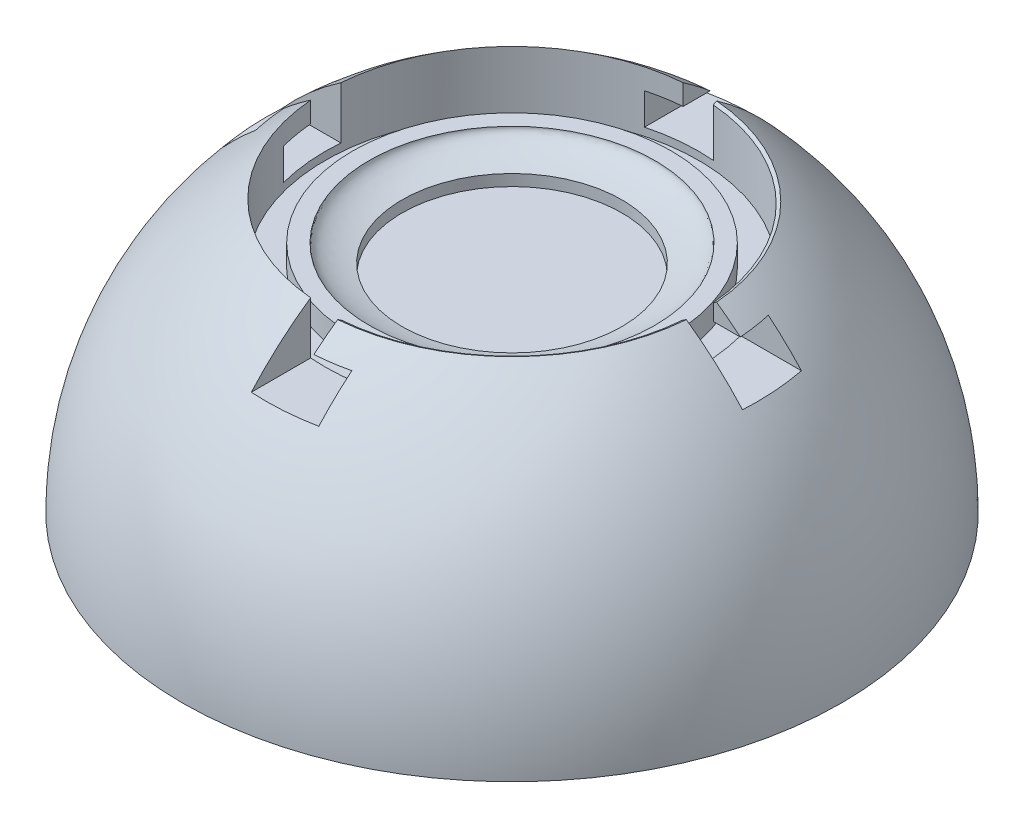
ISO-10303-21;
HEADER;
FILE_DESCRIPTION(('STEP AP214'),'2;1');
FILE_NAME('part.step','',(''),(''),'','','');
FILE_SCHEMA(('AUTOMOTIVE_DESIGN { 1 0 10303 214 1 1 1 1 }'));
ENDSEC;
DATA;
#1=APPLICATION_CONTEXT('core data for automotive mechanical design processes');
#2=APPLICATION_PROTOCOL_DEFINITION('international standard','automotive_design',2000,#1);
#3=PRODUCT_CONTEXT('',#1,'mechanical');
#4=PRODUCT('Part','Part','',(#3));
#5=PRODUCT_RELATED_PRODUCT_CATEGORY('part','',(#4));
#6=PRODUCT_DEFINITION_FORMATION('','',#4);
#7=PRODUCT_DEFINITION_CONTEXT('part definition',#1,'design');
#8=PRODUCT_DEFINITION('design','',#6,#7);
#9=PRODUCT_DEFINITION_SHAPE('','',#8);
#10=(LENGTH_UNIT() NAMED_UNIT(*) SI_UNIT(.MILLI.,.METRE.));
#11=(NAMED_UNIT(*) PLANE_ANGLE_UNIT() SI_UNIT($,.RADIAN.));
#12=(NAMED_UNIT(*) SI_UNIT($,.STERADIAN.) SOLID_ANGLE_UNIT());
#13=UNCERTAINTY_MEASURE_WITH_UNIT(LENGTH_MEASURE(1.E-05),#10,'distance_accuracy_value','');
#14=(GEOMETRIC_REPRESENTATION_CONTEXT(3) GLOBAL_UNCERTAINTY_ASSIGNED_CONTEXT((#13)) GLOBAL_UNIT_ASSIGNED_CONTEXT((#10,
#11,#12)) REPRESENTATION_CONTEXT('',''));
#15=CARTESIAN_POINT('',(0.,0.,0.));
#16=DIRECTION('',(0.,0.,1.));
#17=DIRECTION('',(1.,0.,0.));
#18=AXIS2_PLACEMENT_3D('',#15,#16,#17);
#19=CARTESIAN_POINT('',(0.,6.1,0.));
#20=DIRECTION('',(0.,-1.,0.));
#21=DIRECTION('',(1.,0.,0.));
#22=AXIS2_PLACEMENT_3D('',#19,#20,#21);
#23=CYLINDRICAL_SURFACE('',#22,6.8);
#24=CARTESIAN_POINT('',(0.,7.7,0.));
#25=DIRECTION('',(0.,-1.,0.));
#26=DIRECTION('',(1.,0.,0.));
#27=AXIS2_PLACEMENT_3D('',#24,#25,#26);
#28=CIRCLE('',#27,6.8);
#29=CARTESIAN_POINT('',(6.8,7.7,0.));
#30=VERTEX_POINT('',#29);
#31=EDGE_CURVE('E234',#30,#30,#28,.T.);
#32=ORIENTED_EDGE('',*,*,#31,.T.);
#33=EDGE_LOOP('',(#32));
#34=FACE_BOUND('',#33,.T.);
#35=DIRECTION('',(0.,-1.,0.));
#36=VECTOR('',#35,1.);
#37=CARTESIAN_POINT('',(0.549999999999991,6.1,6.77772085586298));
#38=LINE('',#37,#36);
#39=CARTESIAN_POINT('',(0.549999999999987,9.13736567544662,6.77772085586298));
#40=VERTEX_POINT('',#39);
#41=CARTESIAN_POINT('',(0.549999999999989,9.73736567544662,6.77772085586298));
#42=VERTEX_POINT('',#41);
#43=EDGE_CURVE('E558',#40,#42,#38,.F.);
#44=ORIENTED_EDGE('',*,*,#43,.T.);
#45=CARTESIAN_POINT('',(0.,9.73736567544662,0.));
#46=DIRECTION('',(0.,1.,0.));
#47=DIRECTION('',(-1.,0.,0.));
#48=AXIS2_PLACEMENT_3D('',#45,#46,#47);
#49=CIRCLE('',#48,6.8);
#50=CARTESIAN_POINT('',(6.77772085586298,9.73736567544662,0.550000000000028));
#51=VERTEX_POINT('',#50);
#52=EDGE_CURVE('E56',#42,#51,#49,.T.);
#53=ORIENTED_EDGE('',*,*,#52,.T.);
#54=DIRECTION('',(0.,-1.,0.));
#55=VECTOR('',#54,1.);
#56=CARTESIAN_POINT('',(6.77772085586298,6.1,0.550000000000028));
#57=LINE('',#56,#55);
#58=CARTESIAN_POINT('',(6.77772085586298,7.98736567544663,0.550000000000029));
#59=VERTEX_POINT('',#58);
#60=EDGE_CURVE('E556',#51,#59,#57,.T.);
#61=ORIENTED_EDGE('',*,*,#60,.T.);
#62=CARTESIAN_POINT('',(0.,7.98736567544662,0.));
#63=DIRECTION('',(0.,1.,0.));
#64=DIRECTION('',(-1.,0.,0.));
#65=AXIS2_PLACEMENT_3D('',#62,#63,#64);
#66=CIRCLE('',#65,6.8);
#67=CARTESIAN_POINT('',(6.57095883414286,7.98736567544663,-1.74999999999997));
#68=VERTEX_POINT('',#67);
#69=EDGE_CURVE('E553',#59,#68,#66,.T.);
#70=ORIENTED_EDGE('',*,*,#69,.T.);
#71=DIRECTION('',(0.,-1.,0.));
#72=VECTOR('',#71,1.);
#73=CARTESIAN_POINT('',(6.57095883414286,6.1,-1.74999999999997));
#74=LINE('',#73,#72);
#75=CARTESIAN_POINT('',(6.57095883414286,9.13736567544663,-1.74999999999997));
#76=VERTEX_POINT('',#75);
#77=EDGE_CURVE('E550',#68,#76,#74,.F.);
#78=ORIENTED_EDGE('',*,*,#77,.T.);
#79=CARTESIAN_POINT('',(0.,9.13736567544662,0.));
#80=DIRECTION('',(0.,-1.,0.));
#81=DIRECTION('',(1.,0.,0.));
#82=AXIS2_PLACEMENT_3D('',#79,#80,#81);
#83=CIRCLE('',#82,6.8);
#84=CARTESIAN_POINT('',(6.77772085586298,9.13736567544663,-0.54999999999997));
#85=VERTEX_POINT('',#84);
#86=EDGE_CURVE('E547',#76,#85,#83,.T.);
#87=ORIENTED_EDGE('',*,*,#86,.T.);
#88=DIRECTION('',(0.,-1.,0.));
#89=VECTOR('',#88,1.);
#90=CARTESIAN_POINT('',(6.77772085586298,6.1,-0.549999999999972));
#91=LINE('',#90,#89);
#92=CARTESIAN_POINT('',(6.77772085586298,9.73736567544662,-0.549999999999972));
#93=VERTEX_POINT('',#92);
#94=EDGE_CURVE('E545',#85,#93,#91,.F.);
#95=ORIENTED_EDGE('',*,*,#94,.T.);
#96=CARTESIAN_POINT('',(0.,9.73736567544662,0.));
#97=DIRECTION('',(0.,1.,0.));
#98=DIRECTION('',(-1.,0.,0.));
#99=AXIS2_PLACEMENT_3D('',#96,#97,#98);
#100=CIRCLE('',#99,6.8);
#101=CARTESIAN_POINT('',(0.549999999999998,9.73736567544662,-6.77772085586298));
#102=VERTEX_POINT('',#101);
#103=EDGE_CURVE('E63',#93,#102,#100,.T.);
#104=ORIENTED_EDGE('',*,*,#103,.T.);
#105=DIRECTION('',(0.,-1.,0.));
#106=VECTOR('',#105,1.);
#107=CARTESIAN_POINT('',(0.55,6.1,-6.77772085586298));
#108=LINE('',#107,#106);
#109=CARTESIAN_POINT('',(0.55,7.98736567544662,-6.77772085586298));
#110=VERTEX_POINT('',#109);
#111=EDGE_CURVE('E531',#102,#110,#108,.T.);
#112=ORIENTED_EDGE('',*,*,#111,.T.);
#113=CARTESIAN_POINT('',(0.,7.98736567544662,0.));
#114=DIRECTION('',(0.,1.,0.));
#115=DIRECTION('',(0.,0.,1.));
#116=AXIS2_PLACEMENT_3D('',#113,#114,#115);
#117=CIRCLE('',#116,6.8);
#118=CARTESIAN_POINT('',(-1.75,7.98736567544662,-6.57095883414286));
#119=VERTEX_POINT('',#118);
#120=EDGE_CURVE('E528',#110,#119,#117,.T.);
#121=ORIENTED_EDGE('',*,*,#120,.T.);
#122=DIRECTION('',(0.,-1.,0.));
#123=VECTOR('',#122,1.);
#124=CARTESIAN_POINT('',(-1.75,6.1,-6.57095883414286));
#125=LINE('',#124,#123);
#126=CARTESIAN_POINT('',(-1.75,9.13736567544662,-6.57095883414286));
#127=VERTEX_POINT('',#126);
#128=EDGE_CURVE('E525',#119,#127,#125,.F.);
#129=ORIENTED_EDGE('',*,*,#128,.T.);
#130=CARTESIAN_POINT('',(0.,9.13736567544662,0.));
#131=DIRECTION('',(0.,-1.,0.));
#132=DIRECTION('',(0.,0.,-1.));
#133=AXIS2_PLACEMENT_3D('',#130,#131,#132);
#134=CIRCLE('',#133,6.8);
#135=CARTESIAN_POINT('',(-0.55,9.13736567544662,-6.77772085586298));
#136=VERTEX_POINT('',#135);
#137=EDGE_CURVE('E509',#127,#136,#134,.T.);
#138=ORIENTED_EDGE('',*,*,#137,.T.);
#139=DIRECTION('',(0.,-1.,0.));
#140=VECTOR('',#139,1.);
#141=CARTESIAN_POINT('',(-0.549999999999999,6.1,-6.77772085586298));
#142=LINE('',#141,#140);
#143=CARTESIAN_POINT('',(-0.55,9.88736567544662,-6.77772085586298));
#144=VERTEX_POINT('',#143);
#145=EDGE_CURVE('E505',#136,#144,#142,.F.);
#146=ORIENTED_EDGE('',*,*,#145,.T.);
#147=CARTESIAN_POINT('',(0.,9.88736567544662,0.));
#148=DIRECTION('',(0.,-1.,0.));
#149=DIRECTION('',(1.,0.,0.));
#150=AXIS2_PLACEMENT_3D('',#147,#148,#149);
#151=CIRCLE('',#150,6.80000000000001);
#152=CARTESIAN_POINT('',(-6.77772085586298,9.88736567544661,-0.550000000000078));
#153=VERTEX_POINT('',#152);
#154=EDGE_CURVE('E216',#153,#144,#151,.T.);
#155=ORIENTED_EDGE('',*,*,#154,.F.);
#156=DIRECTION('',(0.,-1.,0.));
#157=VECTOR('',#156,1.);
#158=CARTESIAN_POINT('',(-6.77772085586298,6.1,-0.550000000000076));
#159=LINE('',#158,#157);
#160=CARTESIAN_POINT('',(-6.77772085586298,7.98736567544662,-0.550000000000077));
#161=VERTEX_POINT('',#160);
#162=EDGE_CURVE('E576',#153,#161,#159,.T.);
#163=ORIENTED_EDGE('',*,*,#162,.T.);
#164=CARTESIAN_POINT('',(0.,7.98736567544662,0.));
#165=DIRECTION('',(0.,1.,0.));
#166=DIRECTION('',(0.,0.,1.));
#167=AXIS2_PLACEMENT_3D('',#164,#165,#166);
#168=CIRCLE('',#167,6.8);
#169=CARTESIAN_POINT('',(-6.57095883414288,7.98736567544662,1.74999999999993));
#170=VERTEX_POINT('',#169);
#171=EDGE_CURVE('E573',#161,#170,#168,.T.);
#172=ORIENTED_EDGE('',*,*,#171,.T.);
#173=DIRECTION('',(0.,-1.,0.));
#174=VECTOR('',#173,1.);
#175=CARTESIAN_POINT('',(-6.57095883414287,6.1,1.74999999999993));
#176=LINE('',#175,#174);
#177=CARTESIAN_POINT('',(-6.57095883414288,9.13736567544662,1.74999999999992));
#178=VERTEX_POINT('',#177);
#179=EDGE_CURVE('E571',#170,#178,#176,.F.);
#180=ORIENTED_EDGE('',*,*,#179,.T.);
#181=CARTESIAN_POINT('',(0.,9.13736567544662,0.));
#182=DIRECTION('',(0.,-1.,0.));
#183=DIRECTION('',(0.,0.,-1.));
#184=AXIS2_PLACEMENT_3D('',#181,#182,#183);
#185=CIRCLE('',#184,6.8);
#186=CARTESIAN_POINT('',(-6.77772085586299,9.13736567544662,0.549999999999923));
#187=VERTEX_POINT('',#186);
#188=EDGE_CURVE('E208',#178,#187,#185,.T.);
#189=ORIENTED_EDGE('',*,*,#188,.T.);
#190=DIRECTION('',(0.,-1.,0.));
#191=VECTOR('',#190,1.);
#192=CARTESIAN_POINT('',(-6.77772085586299,6.1,0.549999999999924));
#193=LINE('',#192,#191);
#194=CARTESIAN_POINT('',(-6.77772085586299,9.88736567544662,0.549999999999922));
#195=VERTEX_POINT('',#194);
#196=EDGE_CURVE('E194',#187,#195,#193,.F.);
#197=ORIENTED_EDGE('',*,*,#196,.T.);
#198=CARTESIAN_POINT('',(-0.550000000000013,9.88736567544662,6.77772085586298));
#199=VERTEX_POINT('',#198);
#200=EDGE_CURVE('E206',#199,#195,#151,.T.);
#201=ORIENTED_EDGE('',*,*,#200,.F.);
#202=DIRECTION('',(0.,-1.,0.));
#203=VECTOR('',#202,1.);
#204=CARTESIAN_POINT('',(-0.550000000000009,6.1,6.77772085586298));
#205=LINE('',#204,#203);
#206=CARTESIAN_POINT('',(-0.550000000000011,7.98736567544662,6.77772085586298));
#207=VERTEX_POINT('',#206);
#208=EDGE_CURVE('E209',#199,#207,#205,.T.);
#209=ORIENTED_EDGE('',*,*,#208,.T.);
#210=CARTESIAN_POINT('',(0.,7.98736567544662,0.));
#211=DIRECTION('',(0.,1.,0.));
#212=DIRECTION('',(-1.,0.,0.));
#213=AXIS2_PLACEMENT_3D('',#210,#211,#212);
#214=CIRCLE('',#213,6.8);
#215=CARTESIAN_POINT('',(1.74999999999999,7.98736567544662,6.57095883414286));
#216=VERTEX_POINT('',#215);
#217=EDGE_CURVE('E566',#207,#216,#214,.T.);
#218=ORIENTED_EDGE('',*,*,#217,.T.);
#219=DIRECTION('',(0.,-1.,0.));
#220=VECTOR('',#219,1.);
#221=CARTESIAN_POINT('',(1.74999999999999,6.1,6.57095883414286));
#222=LINE('',#221,#220);
#223=CARTESIAN_POINT('',(1.74999999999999,9.13736567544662,6.57095883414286));
#224=VERTEX_POINT('',#223);
#225=EDGE_CURVE('E563',#216,#224,#222,.F.);
#226=ORIENTED_EDGE('',*,*,#225,.T.);
#227=CARTESIAN_POINT('',(0.,9.13736567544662,0.));
#228=DIRECTION('',(0.,-1.,0.));
#229=DIRECTION('',(1.,0.,0.));
#230=AXIS2_PLACEMENT_3D('',#227,#228,#229);
#231=CIRCLE('',#230,6.8);
#232=EDGE_CURVE('E560',#224,#40,#231,.T.);
#233=ORIENTED_EDGE('',*,*,#232,.T.);
#234=EDGE_LOOP('',(#44,#53,#61,#70,#78,#87,#95,#104,#112,#121,#129,#138,#146,#155,#163,#172,
#180,#189,#197,#201,#209,#218,#226,#233));
#235=FACE_BOUND('',#234,.T.);
#236=ADVANCED_FACE('F39',(#34,#235),#23,.F.);
#237=CARTESIAN_POINT('',(0.,0.,0.));
#238=DIRECTION('',(0.,-1.,0.));
#239=DIRECTION('',(1.,0.,0.));
#240=AXIS2_PLACEMENT_3D('',#237,#238,#239);
#241=SPHERICAL_SURFACE('',#240,12.);
#242=CARTESIAN_POINT('',(0.,0.,0.));
#243=DIRECTION('',(0.,-1.,0.));
#244=DIRECTION('',(1.,0.,0.));
#245=AXIS2_PLACEMENT_3D('',#242,#243,#244);
#246=CIRCLE('',#245,12.);
#247=CARTESIAN_POINT('',(12.,0.,0.));
#248=VERTEX_POINT('',#247);
#249=EDGE_CURVE('E215',#248,#248,#246,.T.);
#250=ORIENTED_EDGE('',*,*,#249,.F.);
#251=EDGE_LOOP('',(#250));
#252=FACE_BOUND('',#251,.T.);
#253=CARTESIAN_POINT('',(0.,0.,0.550000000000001));
#254=DIRECTION('',(0.,0.,-1.));
#255=DIRECTION('',(-1.,0.,0.));
#256=AXIS2_PLACEMENT_3D('',#253,#254,#255);
#257=CIRCLE('',#256,11.9873892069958);
#258=CARTESIAN_POINT('',(8.93865144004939,7.98736567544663,0.550000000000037));
#259=VERTEX_POINT('',#258);
#260=CARTESIAN_POINT('',(6.895846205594,9.80534574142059,0.550000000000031));
#261=VERTEX_POINT('',#260);
#262=EDGE_CURVE('E273',#259,#261,#257,.F.);
#263=ORIENTED_EDGE('',*,*,#262,.T.);
#264=CARTESIAN_POINT('',(0.,9.80534574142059,0.));
#265=DIRECTION('',(0.,-1.,0.));
#266=DIRECTION('',(1.,0.,0.));
#267=AXIS2_PLACEMENT_3D('',#264,#265,#266);
#268=CIRCLE('',#267,6.91774492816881);
#269=CARTESIAN_POINT('',(0.549999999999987,9.80534574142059,6.89584620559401));
#270=VERTEX_POINT('',#269);
#271=EDGE_CURVE('E289',#261,#270,#268,.T.);
#272=ORIENTED_EDGE('',*,*,#271,.T.);
#273=CARTESIAN_POINT('',(0.549999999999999,0.,0.));
#274=DIRECTION('',(-1.,0.,0.));
#275=DIRECTION('',(0.,-1.,0.));
#276=AXIS2_PLACEMENT_3D('',#273,#274,#275);
#277=CIRCLE('',#276,11.9873892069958);
#278=CARTESIAN_POINT('',(0.549999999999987,9.13736567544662,7.7592556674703));
#279=VERTEX_POINT('',#278);
#280=EDGE_CURVE('E271',#270,#279,#277,.F.);
#281=ORIENTED_EDGE('',*,*,#280,.T.);
#282=CARTESIAN_POINT('',(0.,9.13736567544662,0.));
#283=DIRECTION('',(0.,-1.,0.));
#284=DIRECTION('',(1.,0.,0.));
#285=AXIS2_PLACEMENT_3D('',#282,#283,#284);
#286=CIRCLE('',#285,7.77872409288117);
#287=CARTESIAN_POINT('',(1.74999999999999,9.13736567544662,7.57931715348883));
#288=VERTEX_POINT('',#287);
#289=EDGE_CURVE('E268',#279,#288,#286,.F.);
#290=ORIENTED_EDGE('',*,*,#289,.T.);
#291=CARTESIAN_POINT('',(1.75,0.,0.));
#292=DIRECTION('',(-1.,0.,0.));
#293=DIRECTION('',(0.,-1.,0.));
#294=AXIS2_PLACEMENT_3D('',#291,#292,#293);
#295=CIRCLE('',#294,11.8717100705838);
#296=CARTESIAN_POINT('',(1.74999999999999,7.98736567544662,8.78290894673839));
#297=VERTEX_POINT('',#296);
#298=EDGE_CURVE('E265',#288,#297,#295,.F.);
#299=ORIENTED_EDGE('',*,*,#298,.T.);
#300=CARTESIAN_POINT('',(0.,7.98736567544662,0.));
#301=DIRECTION('',(0.,1.,0.));
#302=DIRECTION('',(-1.,0.,0.));
#303=AXIS2_PLACEMENT_3D('',#300,#301,#302);
#304=CIRCLE('',#303,8.95555635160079);
#305=CARTESIAN_POINT('',(-0.550000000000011,7.98736567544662,8.9386514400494));
#306=VERTEX_POINT('',#305);
#307=EDGE_CURVE('E263',#297,#306,#304,.F.);
#308=ORIENTED_EDGE('',*,*,#307,.T.);
#309=CARTESIAN_POINT('',(-0.550000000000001,0.,0.));
#310=DIRECTION('',(1.,0.,0.));
#311=DIRECTION('',(0.,1.,0.));
#312=AXIS2_PLACEMENT_3D('',#309,#310,#311);
#313=CIRCLE('',#312,11.9873892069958);
#314=EDGE_CURVE('E200',#306,#199,#313,.F.);
#315=ORIENTED_EDGE('',*,*,#314,.T.);
#316=ORIENTED_EDGE('',*,*,#200,.T.);
#317=CARTESIAN_POINT('',(0.,0.,0.549999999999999));
#318=DIRECTION('',(0.,0.,-1.));
#319=DIRECTION('',(-1.,0.,0.));
#320=AXIS2_PLACEMENT_3D('',#317,#318,#319);
#321=CIRCLE('',#320,11.9873892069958);
#322=CARTESIAN_POINT('',(-7.75925566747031,9.13736567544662,0.549999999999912));
#323=VERTEX_POINT('',#322);
#324=EDGE_CURVE('E191',#195,#323,#321,.F.);
#325=ORIENTED_EDGE('',*,*,#324,.T.);
#326=CARTESIAN_POINT('',(0.,9.13736567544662,0.));
#327=DIRECTION('',(0.,-1.,0.));
#328=DIRECTION('',(0.,0.,-1.));
#329=AXIS2_PLACEMENT_3D('',#326,#327,#328);
#330=CIRCLE('',#329,7.77872409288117);
#331=CARTESIAN_POINT('',(-7.57931715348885,9.13736567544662,1.74999999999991));
#332=VERTEX_POINT('',#331);
#333=EDGE_CURVE('E201',#323,#332,#330,.F.);
#334=ORIENTED_EDGE('',*,*,#333,.T.);
#335=CARTESIAN_POINT('',(0.,0.,1.75));
#336=DIRECTION('',(0.,0.,-1.));
#337=DIRECTION('',(-1.,0.,0.));
#338=AXIS2_PLACEMENT_3D('',#335,#336,#337);
#339=CIRCLE('',#338,11.8717100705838);
#340=CARTESIAN_POINT('',(-8.78290894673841,7.98736567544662,1.7499999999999));
#341=VERTEX_POINT('',#340);
#342=EDGE_CURVE('E258',#332,#341,#339,.F.);
#343=ORIENTED_EDGE('',*,*,#342,.T.);
#344=CARTESIAN_POINT('',(0.,7.98736567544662,0.));
#345=DIRECTION('',(0.,1.,0.));
#346=DIRECTION('',(0.,0.,1.));
#347=AXIS2_PLACEMENT_3D('',#344,#345,#346);
#348=CIRCLE('',#347,8.95555635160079);
#349=CARTESIAN_POINT('',(-8.9386514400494,7.98736567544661,-0.550000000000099));
#350=VERTEX_POINT('',#349);
#351=EDGE_CURVE('E255',#341,#350,#348,.F.);
#352=ORIENTED_EDGE('',*,*,#351,.T.);
#353=CARTESIAN_POINT('',(0.,0.,-0.550000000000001));
#354=DIRECTION('',(0.,0.,1.));
#355=DIRECTION('',(1.,0.,0.));
#356=AXIS2_PLACEMENT_3D('',#353,#354,#355);
#357=CIRCLE('',#356,11.9873892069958);
#358=EDGE_CURVE('E252',#350,#153,#357,.F.);
#359=ORIENTED_EDGE('',*,*,#358,.T.);
#360=ORIENTED_EDGE('',*,*,#154,.T.);
#361=CARTESIAN_POINT('',(-0.549999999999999,0.,0.));
#362=DIRECTION('',(1.,0.,0.));
#363=DIRECTION('',(0.,1.,0.));
#364=AXIS2_PLACEMENT_3D('',#361,#362,#363);
#365=CIRCLE('',#364,11.9873892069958);
#366=CARTESIAN_POINT('',(-0.55,9.13736567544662,-7.7592556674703));
#367=VERTEX_POINT('',#366);
#368=EDGE_CURVE('E249',#144,#367,#365,.F.);
#369=ORIENTED_EDGE('',*,*,#368,.T.);
#370=CARTESIAN_POINT('',(0.,9.13736567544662,0.));
#371=DIRECTION('',(0.,-1.,0.));
#372=DIRECTION('',(0.,0.,-1.));
#373=AXIS2_PLACEMENT_3D('',#370,#371,#372);
#374=CIRCLE('',#373,7.77872409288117);
#375=CARTESIAN_POINT('',(-1.75,9.13736567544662,-7.57931715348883));
#376=VERTEX_POINT('',#375);
#377=EDGE_CURVE('E246',#367,#376,#374,.F.);
#378=ORIENTED_EDGE('',*,*,#377,.T.);
#379=CARTESIAN_POINT('',(-1.75,0.,0.));
#380=DIRECTION('',(1.,0.,0.));
#381=DIRECTION('',(0.,0.,-1.));
#382=AXIS2_PLACEMENT_3D('',#379,#380,#381);
#383=CIRCLE('',#382,11.8717100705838);
#384=CARTESIAN_POINT('',(-1.75,7.98736567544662,-8.78290894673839));
#385=VERTEX_POINT('',#384);
#386=EDGE_CURVE('E243',#376,#385,#383,.F.);
#387=ORIENTED_EDGE('',*,*,#386,.T.);
#388=CARTESIAN_POINT('',(0.,7.98736567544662,0.));
#389=DIRECTION('',(0.,1.,0.));
#390=DIRECTION('',(0.,0.,1.));
#391=AXIS2_PLACEMENT_3D('',#388,#389,#390);
#392=CIRCLE('',#391,8.95555635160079);
#393=CARTESIAN_POINT('',(0.55,7.98736567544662,-8.9386514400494));
#394=VERTEX_POINT('',#393);
#395=EDGE_CURVE('E240',#385,#394,#392,.F.);
#396=ORIENTED_EDGE('',*,*,#395,.T.);
#397=CARTESIAN_POINT('',(0.550000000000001,0.,0.));
#398=DIRECTION('',(-1.,0.,0.));
#399=DIRECTION('',(0.,-1.,0.));
#400=AXIS2_PLACEMENT_3D('',#397,#398,#399);
#401=CIRCLE('',#400,11.9873892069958);
#402=CARTESIAN_POINT('',(0.55,9.80534574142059,-6.895846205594));
#403=VERTEX_POINT('',#402);
#404=EDGE_CURVE('E237',#394,#403,#401,.F.);
#405=ORIENTED_EDGE('',*,*,#404,.T.);
#406=CARTESIAN_POINT('',(0.,9.80534574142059,0.));
#407=DIRECTION('',(0.,-1.,0.));
#408=DIRECTION('',(1.,0.,0.));
#409=AXIS2_PLACEMENT_3D('',#406,#407,#408);
#410=CIRCLE('',#409,6.9177449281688);
#411=CARTESIAN_POINT('',(6.895846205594,9.80534574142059,-0.549999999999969));
#412=VERTEX_POINT('',#411);
#413=EDGE_CURVE('E286',#403,#412,#410,.T.);
#414=ORIENTED_EDGE('',*,*,#413,.T.);
#415=CARTESIAN_POINT('',(0.,0.,-0.549999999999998));
#416=DIRECTION('',(0.,0.,1.));
#417=DIRECTION('',(1.,0.,0.));
#418=AXIS2_PLACEMENT_3D('',#415,#416,#417);
#419=CIRCLE('',#418,11.9873892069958);
#420=CARTESIAN_POINT('',(7.7592556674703,9.13736567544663,-0.549999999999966));
#421=VERTEX_POINT('',#420);
#422=EDGE_CURVE('E284',#412,#421,#419,.F.);
#423=ORIENTED_EDGE('',*,*,#422,.T.);
#424=CARTESIAN_POINT('',(0.,9.13736567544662,0.));
#425=DIRECTION('',(0.,-1.,0.));
#426=DIRECTION('',(1.,0.,0.));
#427=AXIS2_PLACEMENT_3D('',#424,#425,#426);
#428=CIRCLE('',#427,7.77872409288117);
#429=CARTESIAN_POINT('',(7.57931715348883,9.13736567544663,-1.74999999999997));
#430=VERTEX_POINT('',#429);
#431=EDGE_CURVE('E281',#421,#430,#428,.F.);
#432=ORIENTED_EDGE('',*,*,#431,.T.);
#433=CARTESIAN_POINT('',(0.,0.,-1.75));
#434=DIRECTION('',(0.,0.,1.));
#435=DIRECTION('',(1.,0.,0.));
#436=AXIS2_PLACEMENT_3D('',#433,#434,#435);
#437=CIRCLE('',#436,11.8717100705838);
#438=CARTESIAN_POINT('',(8.78290894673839,7.98736567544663,-1.74999999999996));
#439=VERTEX_POINT('',#438);
#440=EDGE_CURVE('E278',#430,#439,#437,.F.);
#441=ORIENTED_EDGE('',*,*,#440,.T.);
#442=CARTESIAN_POINT('',(0.,7.98736567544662,0.));
#443=DIRECTION('',(0.,1.,0.));
#444=DIRECTION('',(-1.,0.,0.));
#445=AXIS2_PLACEMENT_3D('',#442,#443,#444);
#446=CIRCLE('',#445,8.95555635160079);
#447=EDGE_CURVE('E275',#439,#259,#446,.F.);
#448=ORIENTED_EDGE('',*,*,#447,.T.);
#449=EDGE_LOOP('',(#263,#272,#281,#290,#299,#308,#315,#316,#325,#334,#343,#352,#359,#360,#369,
#378,#387,#396,#405,#414,#423,#432,#441,#448));
#450=FACE_BOUND('',#449,.T.);
#451=ADVANCED_FACE('F213',(#252,#450),#241,.T.);
#452=CARTESIAN_POINT('',(5.8,7.7,0.));
#453=DIRECTION('',(0.,1.,0.));
#454=DIRECTION('',(-1.,0.,0.));
#455=AXIS2_PLACEMENT_3D('',#452,#453,#454);
#456=PLANE('',#455);
#457=CARTESIAN_POINT('',(0.,7.7,0.));
#458=DIRECTION('',(0.,-1.,0.));
#459=DIRECTION('',(1.,0.,0.));
#460=AXIS2_PLACEMENT_3D('',#457,#458,#459);
#461=CIRCLE('',#460,5.8);
#462=CARTESIAN_POINT('',(5.8,7.7,0.));
#463=VERTEX_POINT('',#462);
#464=EDGE_CURVE('E231',#463,#463,#461,.T.);
#465=ORIENTED_EDGE('',*,*,#464,.T.);
#466=EDGE_LOOP('',(#465));
#467=FACE_BOUND('',#466,.T.);
#468=ORIENTED_EDGE('',*,*,#31,.F.);
#469=EDGE_LOOP('',(#468));
#470=FACE_BOUND('',#469,.T.);
#471=ADVANCED_FACE('F382',(#467,#470),#456,.T.);
#472=CARTESIAN_POINT('',(0.,6.1,0.));
#473=DIRECTION('',(0.,-1.,0.));
#474=DIRECTION('',(1.,0.,0.));
#475=AXIS2_PLACEMENT_3D('',#472,#473,#474);
#476=CYLINDRICAL_SURFACE('',#475,5.8);
#477=CARTESIAN_POINT('',(0.,8.5,0.));
#478=DIRECTION('',(0.,-1.,0.));
#479=DIRECTION('',(1.,0.,0.));
#480=AXIS2_PLACEMENT_3D('',#477,#478,#479);
#481=CIRCLE('',#480,5.8);
#482=CARTESIAN_POINT('',(5.8,8.5,0.));
#483=VERTEX_POINT('',#482);
#484=EDGE_CURVE('E228',#483,#483,#481,.T.);
#485=ORIENTED_EDGE('',*,*,#484,.T.);
#486=EDGE_LOOP('',(#485));
#487=FACE_BOUND('',#486,.T.);
#488=ORIENTED_EDGE('',*,*,#464,.F.);
#489=EDGE_LOOP('',(#488));
#490=FACE_BOUND('',#489,.T.);
#491=ADVANCED_FACE('F388',(#487,#490),#476,.T.);
#492=CARTESIAN_POINT('',(5.2,8.5,0.));
#493=DIRECTION('',(0.,1.,0.));
#494=DIRECTION('',(-1.,0.,0.));
#495=AXIS2_PLACEMENT_3D('',#492,#493,#494);
#496=PLANE('',#495);
#497=CARTESIAN_POINT('',(0.,8.5,0.));
#498=DIRECTION('',(0.,-1.,0.));
#499=DIRECTION('',(1.,0.,0.));
#500=AXIS2_PLACEMENT_3D('',#497,#498,#499);
#501=CIRCLE('',#500,5.2);
#502=CARTESIAN_POINT('',(5.2,8.5,0.));
#503=VERTEX_POINT('',#502);
#504=EDGE_CURVE('E219',#503,#503,#501,.T.);
#505=ORIENTED_EDGE('',*,*,#504,.T.);
#506=EDGE_LOOP('',(#505));
#507=FACE_BOUND('',#506,.T.);
#508=ORIENTED_EDGE('',*,*,#484,.F.);
#509=EDGE_LOOP('',(#508));
#510=FACE_BOUND('',#509,.T.);
#511=ADVANCED_FACE('F393',(#507,#510),#496,.T.);
#512=CARTESIAN_POINT('',(0.,8.5,0.));
#513=DIRECTION('',(0.,0.,-1.));
#514=DIRECTION('',(1.,0.,0.));
#515=AXIS2_PLACEMENT_3D('',#512,#513,#514);
#516=ELLIPSE('',#515,5.2,0.999999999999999);
#517=TRIMMED_CURVE('',#516,(PARAMETER_VALUE(-1.5707963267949)),
(PARAMETER_VALUE(1.5707963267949)),.T.,.PARAMETER.);
#518=CARTESIAN_POINT('',(0.,6.1,0.));
#519=DIRECTION('',(0.,-1.,0.));
#520=AXIS1_PLACEMENT('',#518,#519);
#521=SURFACE_OF_REVOLUTION('',#517,#520);
#522=CARTESIAN_POINT('',(0.,7.86102893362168,0.));
#523=DIRECTION('',(0.,-1.,0.));
#524=DIRECTION('',(1.,0.,0.));
#525=AXIS2_PLACEMENT_3D('',#522,#523,#524);
#526=CIRCLE('',#525,4.);
#527=CARTESIAN_POINT('',(4.,7.86102893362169,0.));
#528=VERTEX_POINT('',#527);
#529=EDGE_CURVE('E44',#528,#528,#526,.F.);
#530=ORIENTED_EDGE('',*,*,#529,.F.);
#531=EDGE_LOOP('',(#530));
#532=FACE_BOUND('',#531,.T.);
#533=ORIENTED_EDGE('',*,*,#504,.F.);
#534=EDGE_LOOP('',(#533));
#535=FACE_BOUND('',#534,.T.);
#536=ADVANCED_FACE('F399',(#532,#535),#521,.F.);
#537=CARTESIAN_POINT('',(0.,0.,0.));
#538=DIRECTION('',(0.,-1.,0.));
#539=DIRECTION('',(1.,0.,0.));
#540=AXIS2_PLACEMENT_3D('',#537,#538,#539);
#541=SPHERICAL_SURFACE('',#540,6.1);
#542=CARTESIAN_POINT('',(0.,0.203391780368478,0.));
#543=DIRECTION('',(0.,-1.,0.));
#544=DIRECTION('',(1.,0.,0.));
#545=AXIS2_PLACEMENT_3D('',#542,#543,#544);
#546=CIRCLE('',#545,6.09660821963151);
#547=CARTESIAN_POINT('',(6.09660821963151,0.203391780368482,0.));
#548=VERTEX_POINT('',#547);
#549=EDGE_CURVE('E49',#548,#548,#546,.T.);
#550=ORIENTED_EDGE('',*,*,#549,.T.);
#551=EDGE_LOOP('',(#550));
#552=FACE_BOUND('',#551,.T.);
#553=ADVANCED_FACE('F403',(#552),#541,.F.);
#554=CARTESIAN_POINT('',(6.1,0.,0.));
#555=DIRECTION('',(0.,-1.,0.));
#556=DIRECTION('',(1.,0.,0.));
#557=AXIS2_PLACEMENT_3D('',#554,#555,#556);
#558=PLANE('',#557);
#559=CARTESIAN_POINT('',(0.,0.,0.));
#560=DIRECTION('',(0.,-1.,0.));
#561=DIRECTION('',(1.,0.,0.));
#562=AXIS2_PLACEMENT_3D('',#559,#560,#561);
#563=CIRCLE('',#562,6.3);
#564=CARTESIAN_POINT('',(6.3,0.,0.));
#565=VERTEX_POINT('',#564);
#566=EDGE_CURVE('E11',#565,#565,#563,.F.);
#567=ORIENTED_EDGE('',*,*,#566,.T.);
#568=EDGE_LOOP('',(#567));
#569=FACE_BOUND('',#568,.T.);
#570=CARTESIAN_POINT('',(0.,0.,8.));
#571=DIRECTION('',(0.,-1.,0.));
#572=DIRECTION('',(0.,0.,-1.));
#573=AXIS2_PLACEMENT_3D('',#570,#571,#572);
#574=CIRCLE('',#573,1.1);
#575=CARTESIAN_POINT('',(0.,0.,6.9));
#576=VERTEX_POINT('',#575);
#577=EDGE_CURVE('E489',#576,#576,#574,.T.);
#578=ORIENTED_EDGE('',*,*,#577,.F.);
#579=EDGE_LOOP('',(#578));
#580=FACE_BOUND('',#579,.T.);
#581=CARTESIAN_POINT('',(8.,0.,0.));
#582=DIRECTION('',(0.,-1.,0.));
#583=DIRECTION('',(0.,0.,-1.));
#584=AXIS2_PLACEMENT_3D('',#581,#582,#583);
#585=CIRCLE('',#584,1.1);
#586=CARTESIAN_POINT('',(8.,0.,-1.1));
#587=VERTEX_POINT('',#586);
#588=EDGE_CURVE('E493',#587,#587,#585,.T.);
#589=ORIENTED_EDGE('',*,*,#588,.F.);
#590=EDGE_LOOP('',(#589));
#591=FACE_BOUND('',#590,.T.);
#592=CARTESIAN_POINT('',(0.,0.,-8.));
#593=DIRECTION('',(0.,-1.,0.));
#594=DIRECTION('',(0.,0.,-1.));
#595=AXIS2_PLACEMENT_3D('',#592,#593,#594);
#596=CIRCLE('',#595,1.1);
#597=CARTESIAN_POINT('',(0.,0.,-9.1));
#598=VERTEX_POINT('',#597);
#599=EDGE_CURVE('E497',#598,#598,#596,.T.);
#600=ORIENTED_EDGE('',*,*,#599,.F.);
#601=EDGE_LOOP('',(#600));
#602=FACE_BOUND('',#601,.T.);
#603=CARTESIAN_POINT('',(-8.,0.,0.));
#604=DIRECTION('',(0.,-1.,0.));
#605=DIRECTION('',(0.,0.,-1.));
#606=AXIS2_PLACEMENT_3D('',#603,#604,#605);
#607=CIRCLE('',#606,1.1);
#608=CARTESIAN_POINT('',(-8.,0.,-1.1));
#609=VERTEX_POINT('',#608);
#610=EDGE_CURVE('E501',#609,#609,#607,.T.);
#611=ORIENTED_EDGE('',*,*,#610,.F.);
#612=EDGE_LOOP('',(#611));
#613=FACE_BOUND('',#612,.T.);
#614=ORIENTED_EDGE('',*,*,#249,.T.);
#615=EDGE_LOOP('',(#614));
#616=FACE_BOUND('',#615,.T.);
#617=ADVANCED_FACE('F407',(#569,#580,#591,#602,#613,#616),#558,.T.);
#618=CARTESIAN_POINT('',(-8.,3.,0.));
#619=DIRECTION('',(0.,-1.,0.));
#620=DIRECTION('',(0.,0.,-1.));
#621=AXIS2_PLACEMENT_3D('',#618,#619,#620);
#622=CYLINDRICAL_SURFACE('',#621,1.1);
#623=CARTESIAN_POINT('',(-8.,3.,0.));
#624=DIRECTION('',(0.,-1.,0.));
#625=DIRECTION('',(0.,0.,-1.));
#626=AXIS2_PLACEMENT_3D('',#623,#624,#625);
#627=CIRCLE('',#626,1.1);
#628=CARTESIAN_POINT('',(-8.,3.,-1.1));
#629=VERTEX_POINT('',#628);
#630=EDGE_CURVE('E504',#629,#629,#627,.T.);
#631=ORIENTED_EDGE('',*,*,#630,.F.);
#632=EDGE_LOOP('',(#631));
#633=FACE_BOUND('',#632,.T.);
#634=ORIENTED_EDGE('',*,*,#610,.T.);
#635=EDGE_LOOP('',(#634));
#636=FACE_BOUND('',#635,.T.);
#637=ADVANCED_FACE('F410',(#633,#636),#622,.F.);
#638=CARTESIAN_POINT('',(-8.,3.,0.));
#639=DIRECTION('',(0.,-1.,0.));
#640=DIRECTION('',(0.,0.,-1.));
#641=AXIS2_PLACEMENT_3D('',#638,#639,#640);
#642=PLANE('',#641);
#643=ORIENTED_EDGE('',*,*,#630,.T.);
#644=EDGE_LOOP('',(#643));
#645=FACE_BOUND('',#644,.T.);
#646=ADVANCED_FACE('F415',(#645),#642,.T.);
#647=CARTESIAN_POINT('',(0.,3.,-8.));
#648=DIRECTION('',(0.,-1.,0.));
#649=DIRECTION('',(0.,0.,-1.));
#650=AXIS2_PLACEMENT_3D('',#647,#648,#649);
#651=CYLINDRICAL_SURFACE('',#650,1.1);
#652=CARTESIAN_POINT('',(0.,3.,-8.));
#653=DIRECTION('',(0.,-1.,0.));
#654=DIRECTION('',(0.,0.,-1.));
#655=AXIS2_PLACEMENT_3D('',#652,#653,#654);
#656=CIRCLE('',#655,1.1);
#657=CARTESIAN_POINT('',(0.,3.,-9.1));
#658=VERTEX_POINT('',#657);
#659=EDGE_CURVE('E513',#658,#658,#656,.T.);
#660=ORIENTED_EDGE('',*,*,#659,.F.);
#661=EDGE_LOOP('',(#660));
#662=FACE_BOUND('',#661,.T.);
#663=ORIENTED_EDGE('',*,*,#599,.T.);
#664=EDGE_LOOP('',(#663));
#665=FACE_BOUND('',#664,.T.);
#666=ADVANCED_FACE('F419',(#662,#665),#651,.F.);
#667=CARTESIAN_POINT('',(0.,3.,-8.));
#668=DIRECTION('',(0.,-1.,0.));
#669=DIRECTION('',(0.,0.,-1.));
#670=AXIS2_PLACEMENT_3D('',#667,#668,#669);
#671=PLANE('',#670);
#672=ORIENTED_EDGE('',*,*,#659,.T.);
#673=EDGE_LOOP('',(#672));
#674=FACE_BOUND('',#673,.T.);
#675=ADVANCED_FACE('F423',(#674),#671,.T.);
#676=CARTESIAN_POINT('',(8.,3.,0.));
#677=DIRECTION('',(0.,-1.,0.));
#678=DIRECTION('',(0.,0.,-1.));
#679=AXIS2_PLACEMENT_3D('',#676,#677,#678);
#680=CYLINDRICAL_SURFACE('',#679,1.1);
#681=CARTESIAN_POINT('',(8.,3.,0.));
#682=DIRECTION('',(0.,-1.,0.));
#683=DIRECTION('',(0.,0.,-1.));
#684=AXIS2_PLACEMENT_3D('',#681,#682,#683);
#685=CIRCLE('',#684,1.1);
#686=CARTESIAN_POINT('',(8.,3.,-1.1));
#687=VERTEX_POINT('',#686);
#688=EDGE_CURVE('E517',#687,#687,#685,.T.);
#689=ORIENTED_EDGE('',*,*,#688,.F.);
#690=EDGE_LOOP('',(#689));
#691=FACE_BOUND('',#690,.T.);
#692=ORIENTED_EDGE('',*,*,#588,.T.);
#693=EDGE_LOOP('',(#692));
#694=FACE_BOUND('',#693,.T.);
#695=ADVANCED_FACE('F427',(#691,#694),#680,.F.);
#696=CARTESIAN_POINT('',(8.,3.,0.));
#697=DIRECTION('',(0.,-1.,0.));
#698=DIRECTION('',(0.,0.,-1.));
#699=AXIS2_PLACEMENT_3D('',#696,#697,#698);
#700=PLANE('',#699);
#701=ORIENTED_EDGE('',*,*,#688,.T.);
#702=EDGE_LOOP('',(#701));
#703=FACE_BOUND('',#702,.T.);
#704=ADVANCED_FACE('F431',(#703),#700,.T.);
#705=CARTESIAN_POINT('',(0.,3.,8.));
#706=DIRECTION('',(0.,-1.,0.));
#707=DIRECTION('',(0.,0.,-1.));
#708=AXIS2_PLACEMENT_3D('',#705,#706,#707);
#709=CYLINDRICAL_SURFACE('',#708,1.1);
#710=CARTESIAN_POINT('',(0.,3.,8.));
#711=DIRECTION('',(0.,-1.,0.));
#712=DIRECTION('',(0.,0.,-1.));
#713=AXIS2_PLACEMENT_3D('',#710,#711,#712);
#714=CIRCLE('',#713,1.1);
#715=CARTESIAN_POINT('',(0.,3.,6.9));
#716=VERTEX_POINT('',#715);
#717=EDGE_CURVE('E221',#716,#716,#714,.T.);
#718=ORIENTED_EDGE('',*,*,#717,.F.);
#719=EDGE_LOOP('',(#718));
#720=FACE_BOUND('',#719,.T.);
#721=ORIENTED_EDGE('',*,*,#577,.T.);
#722=EDGE_LOOP('',(#721));
#723=FACE_BOUND('',#722,.T.);
#724=ADVANCED_FACE('F435',(#720,#723),#709,.F.);
#725=CARTESIAN_POINT('',(0.,3.,8.));
#726=DIRECTION('',(0.,-1.,0.));
#727=DIRECTION('',(0.,0.,-1.));
#728=AXIS2_PLACEMENT_3D('',#725,#726,#727);
#729=PLANE('',#728);
#730=ORIENTED_EDGE('',*,*,#717,.T.);
#731=EDGE_LOOP('',(#730));
#732=FACE_BOUND('',#731,.T.);
#733=ADVANCED_FACE('F439',(#732),#729,.T.);
#734=CARTESIAN_POINT('',(-0.55,9.88736567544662,-6.5));
#735=DIRECTION('',(1.,0.,0.));
#736=DIRECTION('',(0.,1.,0.));
#737=AXIS2_PLACEMENT_3D('',#734,#735,#736);
#738=PLANE('',#737);
#739=DIRECTION('',(0.,0.,-1.));
#740=VECTOR('',#739,1.);
#741=CARTESIAN_POINT('',(-0.55,9.13736567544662,-6.5));
#742=LINE('',#741,#740);
#743=EDGE_CURVE('E533',#136,#367,#742,.T.);
#744=ORIENTED_EDGE('',*,*,#743,.T.);
#745=ORIENTED_EDGE('',*,*,#368,.F.);
#746=ORIENTED_EDGE('',*,*,#145,.F.);
#747=EDGE_LOOP('',(#744,#745,#746));
#748=FACE_BOUND('',#747,.T.);
#749=ADVANCED_FACE('F443',(#748),#738,.T.);
#750=CARTESIAN_POINT('',(-0.55,9.13736567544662,-6.5));
#751=DIRECTION('',(0.,-1.,0.));
#752=DIRECTION('',(0.,0.,-1.));
#753=AXIS2_PLACEMENT_3D('',#750,#751,#752);
#754=PLANE('',#753);
#755=DIRECTION('',(0.,0.,-1.));
#756=VECTOR('',#755,1.);
#757=CARTESIAN_POINT('',(-1.75,9.13736567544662,-6.5));
#758=LINE('',#757,#756);
#759=EDGE_CURVE('E536',#127,#376,#758,.T.);
#760=ORIENTED_EDGE('',*,*,#759,.T.);
#761=ORIENTED_EDGE('',*,*,#377,.F.);
#762=ORIENTED_EDGE('',*,*,#743,.F.);
#763=ORIENTED_EDGE('',*,*,#137,.F.);
#764=EDGE_LOOP('',(#760,#761,#762,#763));
#765=FACE_BOUND('',#764,.T.);
#766=ADVANCED_FACE('F447',(#765),#754,.T.);
#767=CARTESIAN_POINT('',(-1.75,7.98736567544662,-6.5));
#768=DIRECTION('',(1.,0.,0.));
#769=DIRECTION('',(0.,0.,-1.));
#770=AXIS2_PLACEMENT_3D('',#767,#768,#769);
#771=PLANE('',#770);
#772=DIRECTION('',(0.,0.,-1.));
#773=VECTOR('',#772,1.);
#774=CARTESIAN_POINT('',(-1.75,7.98736567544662,-6.5));
#775=LINE('',#774,#773);
#776=EDGE_CURVE('E539',#119,#385,#775,.T.);
#777=ORIENTED_EDGE('',*,*,#776,.T.);
#778=ORIENTED_EDGE('',*,*,#386,.F.);
#779=ORIENTED_EDGE('',*,*,#759,.F.);
#780=ORIENTED_EDGE('',*,*,#128,.F.);
#781=EDGE_LOOP('',(#777,#778,#779,#780));
#782=FACE_BOUND('',#781,.T.);
#783=ADVANCED_FACE('F451',(#782),#771,.T.);
#784=CARTESIAN_POINT('',(-0.55,7.98736567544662,-6.5));
#785=DIRECTION('',(0.,1.,0.));
#786=DIRECTION('',(0.,0.,1.));
#787=AXIS2_PLACEMENT_3D('',#784,#785,#786);
#788=PLANE('',#787);
#789=DIRECTION('',(0.,0.,-1.));
#790=VECTOR('',#789,1.);
#791=CARTESIAN_POINT('',(0.55,7.98736567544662,-6.5));
#792=LINE('',#791,#790);
#793=EDGE_CURVE('E542',#110,#394,#792,.T.);
#794=ORIENTED_EDGE('',*,*,#793,.T.);
#795=ORIENTED_EDGE('',*,*,#395,.F.);
#796=ORIENTED_EDGE('',*,*,#776,.F.);
#797=ORIENTED_EDGE('',*,*,#120,.F.);
#798=EDGE_LOOP('',(#794,#795,#796,#797));
#799=FACE_BOUND('',#798,.T.);
#800=ADVANCED_FACE('F455',(#799),#788,.T.);
#801=CARTESIAN_POINT('',(0.55,9.88736567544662,-6.5));
#802=DIRECTION('',(-1.,0.,0.));
#803=DIRECTION('',(0.,-1.,0.));
#804=AXIS2_PLACEMENT_3D('',#801,#802,#803);
#805=PLANE('',#804);
#806=ORIENTED_EDGE('',*,*,#111,.F.);
#807=CARTESIAN_POINT('',(0.549999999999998,9.73736567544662,-6.77772085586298));
#808=CARTESIAN_POINT('',(0.549999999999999,9.74869521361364,-6.79740868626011));
#809=CARTESIAN_POINT('',(0.55,9.76002498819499,-6.81709638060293));
#810=CARTESIAN_POINT('',(0.55,9.78268501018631,-6.85647149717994));
#811=CARTESIAN_POINT('',(0.55,9.79401525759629,-6.87615891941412));
#812=CARTESIAN_POINT('',(0.55,9.80534574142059,-6.895846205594));
#813=B_SPLINE_CURVE_WITH_KNOTS('',3,(#807,#808,#809,#810,#811,#812),.UNSPECIFIED.,.F.,.F.,(4,2,
4),(0.,0.0681448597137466,0.136289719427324),.UNSPECIFIED.);
#814=EDGE_CURVE('E466',#102,#403,#813,.T.);
#815=ORIENTED_EDGE('',*,*,#814,.T.);
#816=ORIENTED_EDGE('',*,*,#404,.F.);
#817=ORIENTED_EDGE('',*,*,#793,.F.);
#818=EDGE_LOOP('',(#806,#815,#816,#817));
#819=FACE_BOUND('',#818,.T.);
#820=ADVANCED_FACE('F459',(#819),#805,.T.);
#821=CARTESIAN_POINT('',(-6.50000000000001,9.88736567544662,0.549999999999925));
#822=DIRECTION('',(0.,0.,-1.));
#823=DIRECTION('',(-1.,0.,0.));
#824=AXIS2_PLACEMENT_3D('',#821,#822,#823);
#825=PLANE('',#824);
#826=DIRECTION('',(-1.,0.,0.));
#827=VECTOR('',#826,1.);
#828=CARTESIAN_POINT('',(-6.50000000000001,9.13736567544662,0.549999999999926));
#829=LINE('',#828,#827);
#830=EDGE_CURVE('E196',#187,#323,#829,.T.);
#831=ORIENTED_EDGE('',*,*,#830,.T.);
#832=ORIENTED_EDGE('',*,*,#324,.F.);
#833=ORIENTED_EDGE('',*,*,#196,.F.);
#834=EDGE_LOOP('',(#831,#832,#833));
#835=FACE_BOUND('',#834,.T.);
#836=ADVANCED_FACE('F193',(#835),#825,.T.);
#837=CARTESIAN_POINT('',(-6.50000000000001,9.13736567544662,0.549999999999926));
#838=DIRECTION('',(0.,-1.,0.));
#839=DIRECTION('',(0.,0.,-1.));
#840=AXIS2_PLACEMENT_3D('',#837,#838,#839);
#841=PLANE('',#840);
#842=DIRECTION('',(-1.,0.,0.));
#843=VECTOR('',#842,1.);
#844=CARTESIAN_POINT('',(-6.50000000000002,9.13736567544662,1.74999999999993));
#845=LINE('',#844,#843);
#846=EDGE_CURVE('E582',#178,#332,#845,.T.);
#847=ORIENTED_EDGE('',*,*,#846,.T.);
#848=ORIENTED_EDGE('',*,*,#333,.F.);
#849=ORIENTED_EDGE('',*,*,#830,.F.);
#850=ORIENTED_EDGE('',*,*,#188,.F.);
#851=EDGE_LOOP('',(#847,#848,#849,#850));
#852=FACE_BOUND('',#851,.T.);
#853=ADVANCED_FACE('F795',(#852),#841,.T.);
#854=CARTESIAN_POINT('',(-6.50000000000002,7.98736567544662,1.74999999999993));
#855=DIRECTION('',(0.,0.,-1.));
#856=DIRECTION('',(-1.,0.,0.));
#857=AXIS2_PLACEMENT_3D('',#854,#855,#856);
#858=PLANE('',#857);
#859=DIRECTION('',(-1.,0.,0.));
#860=VECTOR('',#859,1.);
#861=CARTESIAN_POINT('',(-6.50000000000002,7.98736567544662,1.74999999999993));
#862=LINE('',#861,#860);
#863=EDGE_CURVE('E585',#170,#341,#862,.T.);
#864=ORIENTED_EDGE('',*,*,#863,.T.);
#865=ORIENTED_EDGE('',*,*,#342,.F.);
#866=ORIENTED_EDGE('',*,*,#846,.F.);
#867=ORIENTED_EDGE('',*,*,#179,.F.);
#868=EDGE_LOOP('',(#864,#865,#866,#867));
#869=FACE_BOUND('',#868,.T.);
#870=ADVANCED_FACE('F784',(#869),#858,.T.);
#871=CARTESIAN_POINT('',(-6.50000000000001,7.98736567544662,0.549999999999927));
#872=DIRECTION('',(0.,1.,0.));
#873=DIRECTION('',(0.,0.,1.));
#874=AXIS2_PLACEMENT_3D('',#871,#872,#873);
#875=PLANE('',#874);
#876=DIRECTION('',(-1.,0.,0.));
#877=VECTOR('',#876,1.);
#878=CARTESIAN_POINT('',(-6.5,7.98736567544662,-0.550000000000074));
#879=LINE('',#878,#877);
#880=EDGE_CURVE('E588',#161,#350,#879,.T.);
#881=ORIENTED_EDGE('',*,*,#880,.T.);
#882=ORIENTED_EDGE('',*,*,#351,.F.);
#883=ORIENTED_EDGE('',*,*,#863,.F.);
#884=ORIENTED_EDGE('',*,*,#171,.F.);
#885=EDGE_LOOP('',(#881,#882,#883,#884));
#886=FACE_BOUND('',#885,.T.);
#887=ADVANCED_FACE('F774',(#886),#875,.T.);
#888=CARTESIAN_POINT('',(-6.5,9.88736567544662,-0.550000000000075));
#889=DIRECTION('',(0.,0.,1.));
#890=DIRECTION('',(1.,0.,0.));
#891=AXIS2_PLACEMENT_3D('',#888,#889,#890);
#892=PLANE('',#891);
#893=ORIENTED_EDGE('',*,*,#358,.F.);
#894=ORIENTED_EDGE('',*,*,#880,.F.);
#895=ORIENTED_EDGE('',*,*,#162,.F.);
#896=EDGE_LOOP('',(#893,#894,#895));
#897=FACE_BOUND('',#896,.T.);
#898=ADVANCED_FACE('F374',(#897),#892,.T.);
#899=CARTESIAN_POINT('',(0.549999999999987,9.88736567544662,6.5));
#900=DIRECTION('',(-1.,0.,0.));
#901=DIRECTION('',(0.,-1.,0.));
#902=AXIS2_PLACEMENT_3D('',#899,#900,#901);
#903=PLANE('',#902);
#904=ORIENTED_EDGE('',*,*,#280,.F.);
#905=CARTESIAN_POINT('',(0.549999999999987,9.80534574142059,6.89584620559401));
#906=CARTESIAN_POINT('',(0.549999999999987,9.79401525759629,6.87615891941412));
#907=CARTESIAN_POINT('',(0.549999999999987,9.78268501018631,6.85647149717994));
#908=CARTESIAN_POINT('',(0.549999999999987,9.76002498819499,6.81709638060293));
#909=CARTESIAN_POINT('',(0.549999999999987,9.74869521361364,6.79740868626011));
#910=CARTESIAN_POINT('',(0.549999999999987,9.73736567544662,6.77772085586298));
#911=B_SPLINE_CURVE_WITH_KNOTS('',3,(#905,#906,#907,#908,#909,#910),.UNSPECIFIED.,.F.,.F.,(4,2,
4),(0.,0.068144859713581,0.13628971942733),.UNSPECIFIED.);
#912=EDGE_CURVE('E292',#270,#42,#911,.T.);
#913=ORIENTED_EDGE('',*,*,#912,.T.);
#914=ORIENTED_EDGE('',*,*,#43,.F.);
#915=DIRECTION('',(0.,0.,1.));
#916=VECTOR('',#915,1.);
#917=CARTESIAN_POINT('',(0.549999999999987,9.13736567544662,6.5));
#918=LINE('',#917,#916);
#919=EDGE_CURVE('E591',#40,#279,#918,.T.);
#920=ORIENTED_EDGE('',*,*,#919,.T.);
#921=EDGE_LOOP('',(#904,#913,#914,#920));
#922=FACE_BOUND('',#921,.T.);
#923=ADVANCED_FACE('F301',(#922),#903,.T.);
#924=CARTESIAN_POINT('',(0.549999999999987,9.13736567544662,6.5));
#925=DIRECTION('',(0.,-1.,0.));
#926=DIRECTION('',(1.,0.,0.));
#927=AXIS2_PLACEMENT_3D('',#924,#925,#926);
#928=PLANE('',#927);
#929=DIRECTION('',(0.,0.,1.));
#930=VECTOR('',#929,1.);
#931=CARTESIAN_POINT('',(1.74999999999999,9.13736567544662,6.5));
#932=LINE('',#931,#930);
#933=EDGE_CURVE('E595',#224,#288,#932,.T.);
#934=ORIENTED_EDGE('',*,*,#933,.T.);
#935=ORIENTED_EDGE('',*,*,#289,.F.);
#936=ORIENTED_EDGE('',*,*,#919,.F.);
#937=ORIENTED_EDGE('',*,*,#232,.F.);
#938=EDGE_LOOP('',(#934,#935,#936,#937));
#939=FACE_BOUND('',#938,.T.);
#940=ADVANCED_FACE('F367',(#939),#928,.T.);
#941=CARTESIAN_POINT('',(1.74999999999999,7.98736567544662,6.5));
#942=DIRECTION('',(-1.,0.,0.));
#943=DIRECTION('',(0.,-1.,0.));
#944=AXIS2_PLACEMENT_3D('',#941,#942,#943);
#945=PLANE('',#944);
#946=DIRECTION('',(0.,0.,1.));
#947=VECTOR('',#946,1.);
#948=CARTESIAN_POINT('',(1.74999999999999,7.98736567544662,6.5));
#949=LINE('',#948,#947);
#950=EDGE_CURVE('E597',#216,#297,#949,.T.);
#951=ORIENTED_EDGE('',*,*,#950,.T.);
#952=ORIENTED_EDGE('',*,*,#298,.F.);
#953=ORIENTED_EDGE('',*,*,#933,.F.);
#954=ORIENTED_EDGE('',*,*,#225,.F.);
#955=EDGE_LOOP('',(#951,#952,#953,#954));
#956=FACE_BOUND('',#955,.T.);
#957=ADVANCED_FACE('F364',(#956),#945,.T.);
#958=CARTESIAN_POINT('',(0.549999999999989,7.98736567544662,6.5));
#959=DIRECTION('',(0.,1.,0.));
#960=DIRECTION('',(-1.,0.,0.));
#961=AXIS2_PLACEMENT_3D('',#958,#959,#960);
#962=PLANE('',#961);
#963=DIRECTION('',(0.,0.,1.));
#964=VECTOR('',#963,1.);
#965=CARTESIAN_POINT('',(-0.550000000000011,7.98736567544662,6.5));
#966=LINE('',#965,#964);
#967=EDGE_CURVE('E581',#207,#306,#966,.T.);
#968=ORIENTED_EDGE('',*,*,#967,.T.);
#969=ORIENTED_EDGE('',*,*,#307,.F.);
#970=ORIENTED_EDGE('',*,*,#950,.F.);
#971=ORIENTED_EDGE('',*,*,#217,.F.);
#972=EDGE_LOOP('',(#968,#969,#970,#971));
#973=FACE_BOUND('',#972,.T.);
#974=ADVANCED_FACE('F360',(#973),#962,.T.);
#975=CARTESIAN_POINT('',(-0.550000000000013,9.88736567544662,6.5));
#976=DIRECTION('',(1.,0.,0.));
#977=DIRECTION('',(0.,1.,0.));
#978=AXIS2_PLACEMENT_3D('',#975,#976,#977);
#979=PLANE('',#978);
#980=ORIENTED_EDGE('',*,*,#314,.F.);
#981=ORIENTED_EDGE('',*,*,#967,.F.);
#982=ORIENTED_EDGE('',*,*,#208,.F.);
#983=EDGE_LOOP('',(#980,#981,#982));
#984=FACE_BOUND('',#983,.T.);
#985=ADVANCED_FACE('F356',(#984),#979,.T.);
#986=CARTESIAN_POINT('',(6.5,9.88736567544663,-0.549999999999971));
#987=DIRECTION('',(0.,0.,1.));
#988=DIRECTION('',(1.,0.,0.));
#989=AXIS2_PLACEMENT_3D('',#986,#987,#988);
#990=PLANE('',#989);
#991=ORIENTED_EDGE('',*,*,#422,.F.);
#992=CARTESIAN_POINT('',(6.895846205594,9.80534574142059,-0.549999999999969));
#993=CARTESIAN_POINT('',(6.87615891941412,9.79401525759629,-0.549999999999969));
#994=CARTESIAN_POINT('',(6.85647149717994,9.78268501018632,-0.549999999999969));
#995=CARTESIAN_POINT('',(6.81709638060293,9.76002498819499,-0.54999999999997));
#996=CARTESIAN_POINT('',(6.7974086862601,9.74869521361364,-0.54999999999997));
#997=CARTESIAN_POINT('',(6.77772085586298,9.73736567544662,-0.54999999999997));
#998=B_SPLINE_CURVE_WITH_KNOTS('',3,(#992,#993,#994,#995,#996,#997),.UNSPECIFIED.,.F.,.F.,(4,2,
4),(0.,0.0681448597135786,0.136289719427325),.UNSPECIFIED.);
#999=EDGE_CURVE('E327',#412,#93,#998,.T.);
#1000=ORIENTED_EDGE('',*,*,#999,.T.);
#1001=ORIENTED_EDGE('',*,*,#94,.F.);
#1002=DIRECTION('',(1.,0.,0.));
#1003=VECTOR('',#1002,1.);
#1004=CARTESIAN_POINT('',(6.5,9.13736567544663,-0.549999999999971));
#1005=LINE('',#1004,#1003);
#1006=EDGE_CURVE('E579',#85,#421,#1005,.T.);
#1007=ORIENTED_EDGE('',*,*,#1006,.T.);
#1008=EDGE_LOOP('',(#991,#1000,#1001,#1007));
#1009=FACE_BOUND('',#1008,.T.);
#1010=ADVANCED_FACE('F351',(#1009),#990,.T.);
#1011=CARTESIAN_POINT('',(6.5,9.13736567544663,-0.549999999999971));
#1012=DIRECTION('',(0.,-1.,0.));
#1013=DIRECTION('',(1.,0.,0.));
#1014=AXIS2_PLACEMENT_3D('',#1011,#1012,#1013);
#1015=PLANE('',#1014);
#1016=DIRECTION('',(1.,0.,0.));
#1017=VECTOR('',#1016,1.);
#1018=CARTESIAN_POINT('',(6.5,9.13736567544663,-1.74999999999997));
#1019=LINE('',#1018,#1017);
#1020=EDGE_CURVE('E604',#76,#430,#1019,.T.);
#1021=ORIENTED_EDGE('',*,*,#1020,.T.);
#1022=ORIENTED_EDGE('',*,*,#431,.F.);
#1023=ORIENTED_EDGE('',*,*,#1006,.F.);
#1024=ORIENTED_EDGE('',*,*,#86,.F.);
#1025=EDGE_LOOP('',(#1021,#1022,#1023,#1024));
#1026=FACE_BOUND('',#1025,.T.);
#1027=ADVANCED_FACE('F348',(#1026),#1015,.T.);
#1028=CARTESIAN_POINT('',(6.5,7.98736567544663,-1.74999999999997));
#1029=DIRECTION('',(0.,0.,1.));
#1030=DIRECTION('',(1.,0.,0.));
#1031=AXIS2_PLACEMENT_3D('',#1028,#1029,#1030);
#1032=PLANE('',#1031);
#1033=DIRECTION('',(1.,0.,0.));
#1034=VECTOR('',#1033,1.);
#1035=CARTESIAN_POINT('',(6.5,7.98736567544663,-1.74999999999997));
#1036=LINE('',#1035,#1034);
#1037=EDGE_CURVE('E607',#68,#439,#1036,.T.);
#1038=ORIENTED_EDGE('',*,*,#1037,.T.);
#1039=ORIENTED_EDGE('',*,*,#440,.F.);
#1040=ORIENTED_EDGE('',*,*,#1020,.F.);
#1041=ORIENTED_EDGE('',*,*,#77,.F.);
#1042=EDGE_LOOP('',(#1038,#1039,#1040,#1041));
#1043=FACE_BOUND('',#1042,.T.);
#1044=ADVANCED_FACE('F344',(#1043),#1032,.T.);
#1045=CARTESIAN_POINT('',(6.5,7.98736567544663,-0.549999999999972));
#1046=DIRECTION('',(0.,1.,0.));
#1047=DIRECTION('',(-1.,0.,0.));
#1048=AXIS2_PLACEMENT_3D('',#1045,#1046,#1047);
#1049=PLANE('',#1048);
#1050=DIRECTION('',(1.,0.,0.));
#1051=VECTOR('',#1050,1.);
#1052=CARTESIAN_POINT('',(6.49999999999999,7.98736567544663,0.550000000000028));
#1053=LINE('',#1052,#1051);
#1054=EDGE_CURVE('E594',#59,#259,#1053,.T.);
#1055=ORIENTED_EDGE('',*,*,#1054,.T.);
#1056=ORIENTED_EDGE('',*,*,#447,.F.);
#1057=ORIENTED_EDGE('',*,*,#1037,.F.);
#1058=ORIENTED_EDGE('',*,*,#69,.F.);
#1059=EDGE_LOOP('',(#1055,#1056,#1057,#1058));
#1060=FACE_BOUND('',#1059,.T.);
#1061=ADVANCED_FACE('F338',(#1060),#1049,.T.);
#1062=CARTESIAN_POINT('',(6.49999999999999,9.88736567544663,0.55000000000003));
#1063=DIRECTION('',(0.,0.,-1.));
#1064=DIRECTION('',(-1.,0.,0.));
#1065=AXIS2_PLACEMENT_3D('',#1062,#1063,#1064);
#1066=PLANE('',#1065);
#1067=ORIENTED_EDGE('',*,*,#60,.F.);
#1068=CARTESIAN_POINT('',(6.77772085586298,9.73736567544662,0.550000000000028));
#1069=CARTESIAN_POINT('',(6.7974086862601,9.74869521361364,0.550000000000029));
#1070=CARTESIAN_POINT('',(6.81709638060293,9.76002498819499,0.55000000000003));
#1071=CARTESIAN_POINT('',(6.85647149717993,9.78268501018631,0.550000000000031));
#1072=CARTESIAN_POINT('',(6.87615891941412,9.79401525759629,0.550000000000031));
#1073=CARTESIAN_POINT('',(6.895846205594,9.80534574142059,0.550000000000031));
#1074=B_SPLINE_CURVE_WITH_KNOTS('',3,(#1068,#1069,#1070,#1071,#1072,#1073),.UNSPECIFIED.,.F.,
.F.,(4,2,4),(0.,0.0681448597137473,0.136289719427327),.UNSPECIFIED.);
#1075=EDGE_CURVE('E320',#51,#261,#1074,.T.);
#1076=ORIENTED_EDGE('',*,*,#1075,.T.);
#1077=ORIENTED_EDGE('',*,*,#262,.F.);
#1078=ORIENTED_EDGE('',*,*,#1054,.F.);
#1079=EDGE_LOOP('',(#1067,#1076,#1077,#1078));
#1080=FACE_BOUND('',#1079,.T.);
#1081=ADVANCED_FACE('F314',(#1080),#1066,.T.);
#1082=CARTESIAN_POINT('',(0.,9.80534574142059,0.));
#1083=DIRECTION('',(0.,1.,0.));
#1084=DIRECTION('',(-1.,0.,0.));
#1085=AXIS2_PLACEMENT_3D('',#1082,#1083,#1084);
#1086=CONICAL_SURFACE('',#1085,6.9177449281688,1.0471975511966);
#1087=ORIENTED_EDGE('',*,*,#1075,.F.);
#1088=ORIENTED_EDGE('',*,*,#52,.F.);
#1089=ORIENTED_EDGE('',*,*,#912,.F.);
#1090=ORIENTED_EDGE('',*,*,#271,.F.);
#1091=EDGE_LOOP('',(#1087,#1088,#1089,#1090));
#1092=FACE_BOUND('',#1091,.T.);
#1093=ADVANCED_FACE('F306',(#1092),#1086,.F.);
#1094=CARTESIAN_POINT('',(0.,9.80534574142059,0.));
#1095=DIRECTION('',(0.,1.,0.));
#1096=DIRECTION('',(-1.,0.,0.));
#1097=AXIS2_PLACEMENT_3D('',#1094,#1095,#1096);
#1098=CONICAL_SURFACE('',#1097,6.9177449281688,1.04719755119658);
#1099=ORIENTED_EDGE('',*,*,#814,.F.);
#1100=ORIENTED_EDGE('',*,*,#103,.F.);
#1101=ORIENTED_EDGE('',*,*,#999,.F.);
#1102=ORIENTED_EDGE('',*,*,#413,.F.);
#1103=EDGE_LOOP('',(#1099,#1100,#1101,#1102));
#1104=FACE_BOUND('',#1103,.T.);
#1105=ADVANCED_FACE('F313',(#1104),#1098,.F.);
#1106=CARTESIAN_POINT('',(0.,0.203391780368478,0.));
#1107=DIRECTION('',(0.,-1.,0.));
#1108=DIRECTION('',(1.,0.,0.));
#1109=AXIS2_PLACEMENT_3D('',#1106,#1107,#1108);
#1110=CONICAL_SURFACE('',#1109,6.09660821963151,0.785398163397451);
#1111=ORIENTED_EDGE('',*,*,#566,.F.);
#1112=EDGE_LOOP('',(#1111));
#1113=FACE_BOUND('',#1112,.T.);
#1114=ORIENTED_EDGE('',*,*,#549,.F.);
#1115=EDGE_LOOP('',(#1114));
#1116=FACE_BOUND('',#1115,.T.);
#1117=ADVANCED_FACE('F42',(#1113,#1116),#1110,.F.);
#1118=CARTESIAN_POINT('',(0.,7.44800609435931,0.));
#1119=DIRECTION('',(0.,1.,0.));
#1120=DIRECTION('',(0.,0.,1.));
#1121=AXIS2_PLACEMENT_3D('',#1118,#1119,#1120);
#1122=CYLINDRICAL_SURFACE('',#1121,4.);
#1123=ORIENTED_EDGE('',*,*,#529,.T.);
#1124=EDGE_LOOP('',(#1123));
#1125=FACE_BOUND('',#1124,.T.);
#1126=CARTESIAN_POINT('',(0.,7.44800609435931,0.));
#1127=DIRECTION('',(0.,1.,0.));
#1128=DIRECTION('',(0.,0.,1.));
#1129=AXIS2_PLACEMENT_3D('',#1126,#1127,#1128);
#1130=CIRCLE('',#1129,4.);
#1131=CARTESIAN_POINT('',(0.,7.44800609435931,4.));
#1132=VERTEX_POINT('',#1131);
#1133=EDGE_CURVE('E612',#1132,#1132,#1130,.T.);
#1134=ORIENTED_EDGE('',*,*,#1133,.F.);
#1135=EDGE_LOOP('',(#1134));
#1136=FACE_BOUND('',#1135,.T.);
#1137=ADVANCED_FACE('F340',(#1125,#1136),#1122,.F.);
#1138=CARTESIAN_POINT('',(0.,7.44800609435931,0.));
#1139=DIRECTION('',(0.,1.,0.));
#1140=DIRECTION('',(0.,0.,1.));
#1141=AXIS2_PLACEMENT_3D('',#1138,#1139,#1140);
#1142=PLANE('',#1141);
#1143=ORIENTED_EDGE('',*,*,#1133,.T.);
#1144=EDGE_LOOP('',(#1143));
#1145=FACE_BOUND('',#1144,.T.);
#1146=ADVANCED_FACE('F481',(#1145),#1142,.T.);
#1147=CLOSED_SHELL('',(#236,#451,#471,#491,#511,#536,#553,#617,#637,#646,#666,#675,#695,#704,
#724,#733,#749,#766,#783,#800,#820,#836,#853,#870,#887,#898,#923,#940,#957,#974,#985,#1010,
#1027,#1044,#1061,#1081,#1093,#1105,#1117,#1137,#1146));
#1148=MANIFOLD_SOLID_BREP('B2',#1147);
#1149=ADVANCED_BREP_SHAPE_REPRESENTATION('',(#18,#1148),#14);
#1150=SHAPE_DEFINITION_REPRESENTATION(#9,#1149);
ENDSEC;
END-ISO-10303-21;
